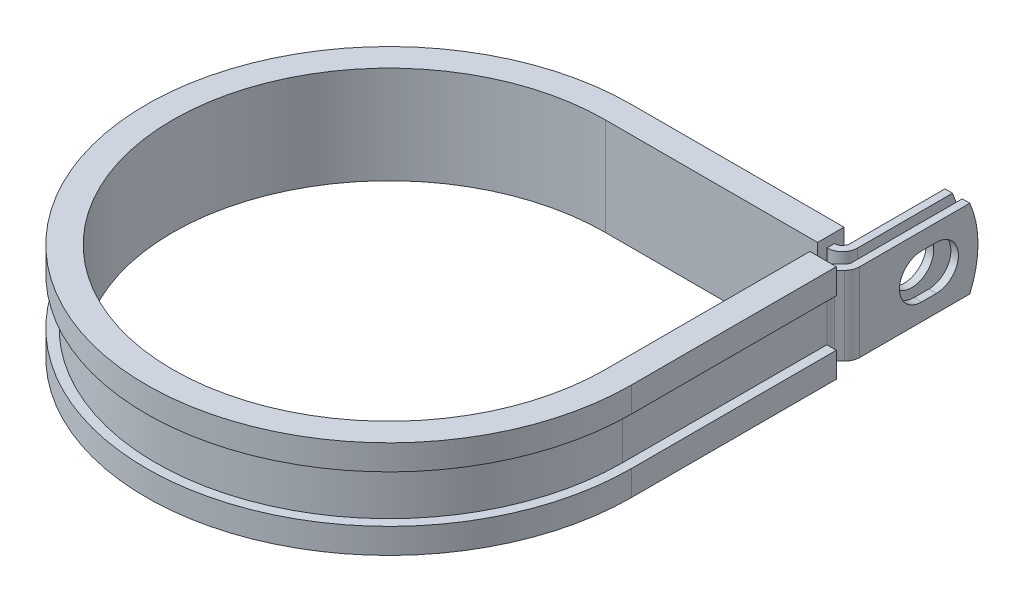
from build123d import *

# Parameters (mm, degrees)
EXTRUDE_THIN1_DEPTH = 6.35
SKETCH2_R           = 3.5687
CUT_EXTRUDE1_DEPTH  = 1.2192
CUT_EXTRUDE2_DEPTH  = 1.2192
CUT_EXTRUDE3_DEPTH  = 93.126919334


with BuildPart() as part:
    # Sketch1 → Extrude-Thin1 (new, symmetric)
    with BuildSketch(Plane(origin=(0, 0, 0), x_dir=(1, 0, 0), z_dir=(0, 1, 0))):
        with BuildLine():
            Line((38.3464698, 55.5498), (38.3464698, 36.449))
            ThreePointArc((38.3464698, 36.449), (38.253663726, 35.982432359), (37.989374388, 35.586895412))
            Line((37.989374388, 35.586895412), (37.163190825, 34.760711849))
            ThreePointArc((37.163190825, 34.760711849), (36.634612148, 33.969637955), (36.449, 33.036502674))
            Line((36.449, 33.036502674), (36.449, 0))
            ThreePointArc((36.449, 0), (-25.773335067, -25.773335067), (0, 36.449))
            Line((0, 36.449), (34.3332698, 36.449))
            ThreePointArc((34.3332698, 36.449), (36.057478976, 37.163190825), (36.7716698, 38.8874))
            Line((36.7716698, 38.8874), (36.7716698, 55.5498))
            Line((36.7716698, 55.5498), (35.5524698, 55.5498))
            Line((35.5524698, 55.5498), (35.5524698, 38.8874))
            ThreePointArc((35.5524698, 38.8874), (35.195374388, 38.025295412), (34.3332698, 37.6682))
            Line((34.3332698, 37.6682), (0, 37.6682))
            ThreePointArc((0, 37.6682), (-26.635439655, -26.635439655), (37.6682, 0))
            Line((37.6682, 0), (37.6682, 33.036502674))
            ThreePointArc((37.6682, 33.036502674), (37.761006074, 33.503070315), (38.025295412, 33.898607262))
            Line((38.025295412, 33.898607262), (38.851478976, 34.724790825))
            ThreePointArc((38.851478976, 34.724790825), (39.380057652, 35.515864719), (39.5656698, 36.449))
            Line((39.5656698, 36.449), (39.5656698, 55.5498))
            Line((39.5656698, 55.5498), (38.3464698, 55.5498))
        make_face()
    extrude(amount=EXTRUDE_THIN1_DEPTH, both=True)

    # Sketch2 → Cut-Extrude1 (cut)
    with BuildSketch(Plane.ZY.offset(-35.5524698)):
        with Locations((-47.625, 0)):
            Circle(SKETCH2_R)
    extrude(amount=-CUT_EXTRUDE1_DEPTH, mode=Mode.SUBTRACT)

    # Sketch3 → Cut-Extrude2 (cut)
    with BuildSketch(Plane(origin=(39.5656698, 0, 0), x_dir=(0, 0, -1), z_dir=(1, 0, 0))):
        with BuildLine():
            Line((46.4312, 3.5687), (48.8188, 3.5687))
            ThreePointArc((48.8188, 3.5687), (52.3875, 0), (48.8188, -3.5687))
            Line((48.8188, -3.5687), (46.4312, -3.5687))
            ThreePointArc((46.4312, -3.5687), (42.8625, 0), (46.4312, 3.5687))
        make_face()
    extrude(amount=-CUT_EXTRUDE2_DEPTH, mode=Mode.SUBTRACT)

    # Sketch4 → Cut-Extrude3 (cut, through all)
    with BuildSketch(Plane.ZY.offset(-35.5524698)):
        with BuildLine():
            Line((-54.224477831, 6.35), (-55.5498, 6.35))
            Line((-55.5498, 6.35), (-55.5498, -8.8e-08))
            ThreePointArc((-55.5498, -8.8e-08), (-55.214937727, 3.24341555), (-54.224477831, 6.35))
        make_face()
        with BuildLine():
            ThreePointArc((-54.224477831, -6.35), (-55.214937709, -3.243415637), (-55.5498, -8.8e-08))
            Line((-55.5498, -8.8e-08), (-55.5498, -6.35))
            Line((-55.5498, -6.35), (-54.224477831, -6.35))
        make_face()
    extrude(amount=-CUT_EXTRUDE3_DEPTH, mode=Mode.SUBTRACT)

    # Sweep1: sweep along a path in Sketch6
    with BuildLine(Plane(origin=(0, 6.35, 0), x_dir=(1, 0, 0), z_dir=(0, 1, 0))) as sweep1_path:
        Line((34.925, 33.036502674), (34.925, 0))
        ThreePointArc((34.925, 0), (-24.695704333, -24.695704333), (0, 34.925))
        Line((0, 34.925), (34.2824698, 34.925))
    # Sketch5 → Sweep1 (sweep)
    with BuildSketch(Plane(origin=(0, 0, -33.036502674), x_dir=(-1, 0, 0), z_dir=(0, 0, -1))):
        Polygon((-37.6682, 6.35), (-36.449, 6.35), (-36.449, -6.35), (-37.6682, -6.35), (-37.6682, -3.81), (-39.1922, -3.81), (-39.1922, -7.874), (-34.925, -7.874), (-34.925, 7.874), (-39.1922, 7.874), (-39.1922, 3.81), (-37.6682, 3.81), align=None)
    sweep(path=sweep1_path.line)


solid = part.part
